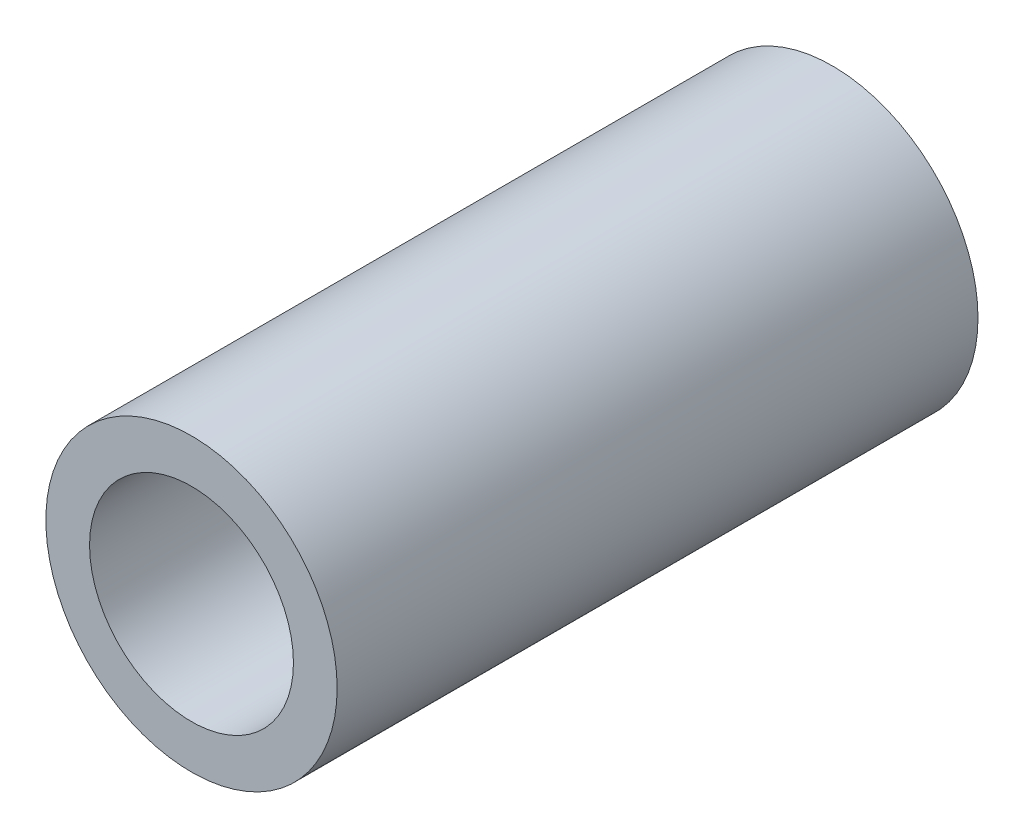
ISO-10303-21;
HEADER;
FILE_DESCRIPTION(('STEP AP214'),'2;1');
FILE_NAME('part.step','',(''),(''),'','','');
FILE_SCHEMA(('AUTOMOTIVE_DESIGN { 1 0 10303 214 1 1 1 1 }'));
ENDSEC;
DATA;
#1=APPLICATION_CONTEXT('core data for automotive mechanical design processes');
#2=APPLICATION_PROTOCOL_DEFINITION('international standard','automotive_design',2000,#1);
#3=PRODUCT_CONTEXT('',#1,'mechanical');
#4=PRODUCT('Part','Part','',(#3));
#5=PRODUCT_RELATED_PRODUCT_CATEGORY('part','',(#4));
#6=PRODUCT_DEFINITION_FORMATION('','',#4);
#7=PRODUCT_DEFINITION_CONTEXT('part definition',#1,'design');
#8=PRODUCT_DEFINITION('design','',#6,#7);
#9=PRODUCT_DEFINITION_SHAPE('','',#8);
#10=(LENGTH_UNIT() NAMED_UNIT(*) SI_UNIT(.MILLI.,.METRE.));
#11=(NAMED_UNIT(*) PLANE_ANGLE_UNIT() SI_UNIT($,.RADIAN.));
#12=(NAMED_UNIT(*) SI_UNIT($,.STERADIAN.) SOLID_ANGLE_UNIT());
#13=UNCERTAINTY_MEASURE_WITH_UNIT(LENGTH_MEASURE(1.E-05),#10,'distance_accuracy_value','');
#14=(GEOMETRIC_REPRESENTATION_CONTEXT(3) GLOBAL_UNCERTAINTY_ASSIGNED_CONTEXT((#13)) GLOBAL_UNIT_ASSIGNED_CONTEXT((#10,
#11,#12)) REPRESENTATION_CONTEXT('',''));
#15=CARTESIAN_POINT('',(0.,0.,0.));
#16=DIRECTION('',(0.,0.,1.));
#17=DIRECTION('',(1.,0.,0.));
#18=AXIS2_PLACEMENT_3D('',#15,#16,#17);
#19=CARTESIAN_POINT('',(0.,0.,11.));
#20=DIRECTION('',(0.,0.,-1.));
#21=DIRECTION('',(-1.,0.,0.));
#22=AXIS2_PLACEMENT_3D('',#19,#20,#21);
#23=CYLINDRICAL_SURFACE('',#22,2.5);
#24=CARTESIAN_POINT('',(0.,0.,11.));
#25=DIRECTION('',(0.,0.,1.));
#26=DIRECTION('',(1.,0.,0.));
#27=AXIS2_PLACEMENT_3D('',#24,#25,#26);
#28=CIRCLE('',#27,2.5);
#29=CARTESIAN_POINT('',(2.5,0.,11.));
#30=VERTEX_POINT('',#29);
#31=EDGE_CURVE('E10',#30,#30,#28,.T.);
#32=ORIENTED_EDGE('',*,*,#31,.F.);
#33=EDGE_LOOP('',(#32));
#34=FACE_BOUND('',#33,.T.);
#35=CARTESIAN_POINT('',(0.,0.,0.));
#36=DIRECTION('',(0.,0.,1.));
#37=DIRECTION('',(1.,0.,0.));
#38=AXIS2_PLACEMENT_3D('',#35,#36,#37);
#39=CIRCLE('',#38,2.5);
#40=CARTESIAN_POINT('',(2.5,0.,0.));
#41=VERTEX_POINT('',#40);
#42=EDGE_CURVE('E35',#41,#41,#39,.T.);
#43=ORIENTED_EDGE('',*,*,#42,.T.);
#44=EDGE_LOOP('',(#43));
#45=FACE_BOUND('',#44,.T.);
#46=ADVANCED_FACE('F32',(#34,#45),#23,.T.);
#47=CARTESIAN_POINT('',(0.,0.,11.));
#48=DIRECTION('',(0.,0.,1.));
#49=DIRECTION('',(1.,0.,0.));
#50=AXIS2_PLACEMENT_3D('',#47,#48,#49);
#51=PLANE('',#50);
#52=CARTESIAN_POINT('',(0.,0.,11.));
#53=DIRECTION('',(0.,0.,1.));
#54=DIRECTION('',(1.,0.,0.));
#55=AXIS2_PLACEMENT_3D('',#52,#53,#54);
#56=CIRCLE('',#55,1.75);
#57=CARTESIAN_POINT('',(1.75,0.,11.));
#58=VERTEX_POINT('',#57);
#59=EDGE_CURVE('E44',#58,#58,#56,.T.);
#60=ORIENTED_EDGE('',*,*,#59,.F.);
#61=EDGE_LOOP('',(#60));
#62=FACE_BOUND('',#61,.T.);
#63=ORIENTED_EDGE('',*,*,#31,.T.);
#64=EDGE_LOOP('',(#63));
#65=FACE_BOUND('',#64,.T.);
#66=ADVANCED_FACE('F59',(#62,#65),#51,.T.);
#67=CARTESIAN_POINT('',(0.,0.,0.));
#68=DIRECTION('',(0.,0.,1.));
#69=DIRECTION('',(1.,0.,0.));
#70=AXIS2_PLACEMENT_3D('',#67,#68,#69);
#71=PLANE('',#70);
#72=ORIENTED_EDGE('',*,*,#42,.F.);
#73=EDGE_LOOP('',(#72));
#74=FACE_BOUND('',#73,.T.);
#75=ADVANCED_FACE('F55',(#74),#71,.F.);
#76=CARTESIAN_POINT('',(0.,0.,7.));
#77=DIRECTION('',(0.,0.,1.));
#78=DIRECTION('',(1.,0.,0.));
#79=AXIS2_PLACEMENT_3D('',#76,#77,#78);
#80=CYLINDRICAL_SURFACE('',#79,1.75);
#81=CARTESIAN_POINT('',(0.,0.,7.));
#82=DIRECTION('',(0.,0.,1.));
#83=DIRECTION('',(1.,0.,0.));
#84=AXIS2_PLACEMENT_3D('',#81,#82,#83);
#85=CIRCLE('',#84,1.75);
#86=CARTESIAN_POINT('',(1.75,0.,7.));
#87=VERTEX_POINT('',#86);
#88=EDGE_CURVE('E42',#87,#87,#85,.T.);
#89=ORIENTED_EDGE('',*,*,#88,.F.);
#90=EDGE_LOOP('',(#89));
#91=FACE_BOUND('',#90,.T.);
#92=ORIENTED_EDGE('',*,*,#59,.T.);
#93=EDGE_LOOP('',(#92));
#94=FACE_BOUND('',#93,.T.);
#95=ADVANCED_FACE('F52',(#91,#94),#80,.F.);
#96=CARTESIAN_POINT('',(0.,0.,7.));
#97=DIRECTION('',(0.,0.,1.));
#98=DIRECTION('',(1.,0.,0.));
#99=AXIS2_PLACEMENT_3D('',#96,#97,#98);
#100=PLANE('',#99);
#101=ORIENTED_EDGE('',*,*,#88,.T.);
#102=EDGE_LOOP('',(#101));
#103=FACE_BOUND('',#102,.T.);
#104=ADVANCED_FACE('F50',(#103),#100,.T.);
#105=CLOSED_SHELL('',(#46,#66,#75,#95,#104));
#106=MANIFOLD_SOLID_BREP('B2',#105);
#107=ADVANCED_BREP_SHAPE_REPRESENTATION('',(#18,#106),#14);
#108=SHAPE_DEFINITION_REPRESENTATION(#9,#107);
ENDSEC;
END-ISO-10303-21;
